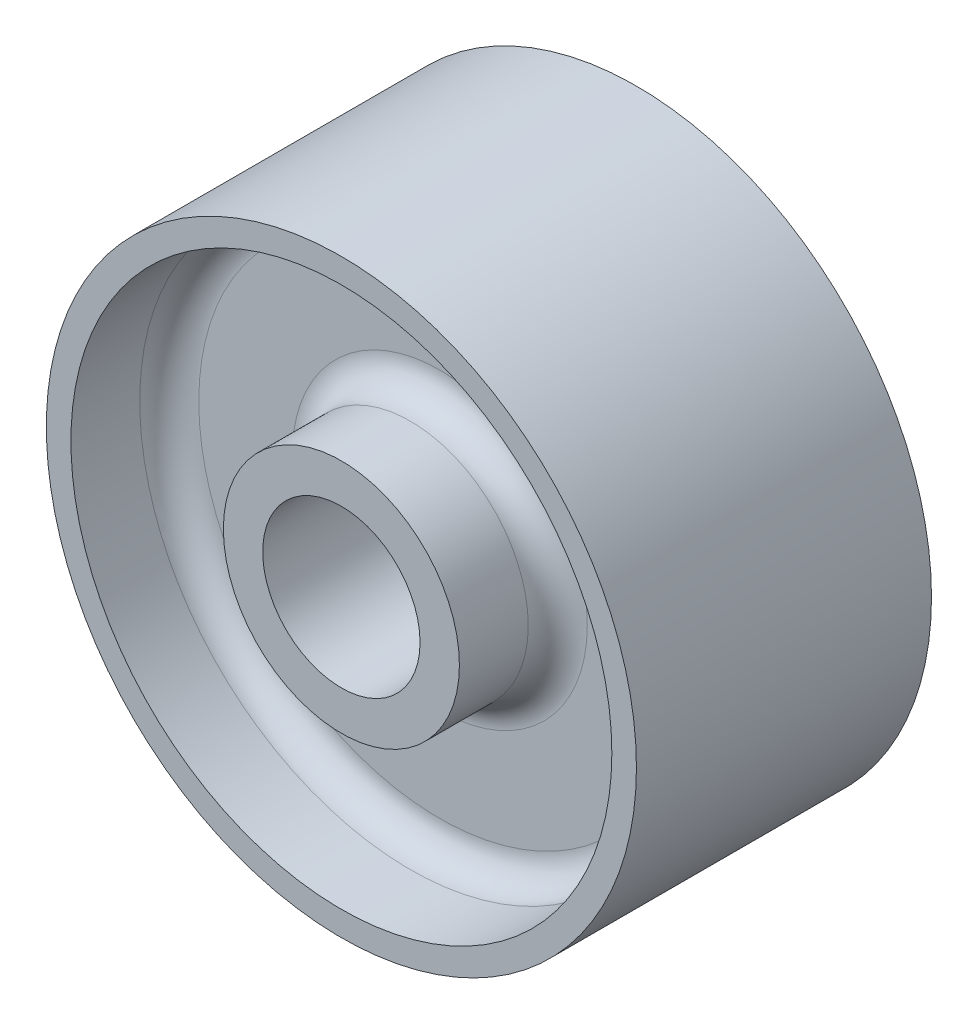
from build123d import *

# Parameters (mm, degrees)
SKETCH1_R          = 60
EXTRUDE1_DEPTH     = 60
SKETCH2_R          = 16
CUT_EXTRUDE2_DEPTH = 104.923048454
SKETCH3_R          = 55
SKETCH3_R_2        = 24
CUT_EXTRUDE3_DEPTH = 20
CUT_EXTRUDE4_START = -20
SKETCH4_R          = 55
SKETCH4_R_2        = 24
CUT_EXTRUDE4_DEPTH = 20
FILLET1_R          = 6
FILLET2_R          = 6


with BuildPart() as part:
    # Sketch1 → Extrude1 (new body)
    with BuildSketch(Plane.XY):
        Circle(SKETCH1_R)
    extrude(amount=EXTRUDE1_DEPTH)

    # Sketch2 → Cut-Extrude2 (cut, through all)
    with BuildSketch(Plane.XY):
        Circle(SKETCH2_R)
    extrude(amount=CUT_EXTRUDE2_DEPTH, mode=Mode.SUBTRACT)

    # Sketch3 → Cut-Extrude3 (cut)
    with BuildSketch(Plane.XY.offset(60)):
        Circle(SKETCH3_R)
        Circle(SKETCH3_R_2, mode=Mode.SUBTRACT)
    extrude(amount=-CUT_EXTRUDE3_DEPTH, mode=Mode.SUBTRACT)

    # Sketch4 → Cut-Extrude4 (cut)
    with BuildSketch(Plane(origin=(0, 0, 0), x_dir=(-1, 0, 0), z_dir=(0, 0, -1)).offset(CUT_EXTRUDE4_START)):
        with Locations(Location((0, 0, 0), (0, 0, 180))):
            Circle(SKETCH4_R)
        with Locations(Location((0, 0, 0), (0, 0, 180))):
            Circle(SKETCH4_R_2, mode=Mode.SUBTRACT)
    extrude(amount=CUT_EXTRUDE4_DEPTH, mode=Mode.SUBTRACT)

    # Fillet1
    fillet1_edges = [part.edges().sort_by_distance(p)[0] for p in [
        (-55, 0, 20),
        (-24, 0, 20),
    ]]
    fillet(fillet1_edges, radius=FILLET1_R)

    # Fillet2
    fillet2_edges = [part.edges().sort_by_distance(p)[0] for p in [
        (-55, 0, 40),
        (-24, 0, 40),
    ]]
    fillet(fillet2_edges, radius=FILLET2_R)


solid = part.part
